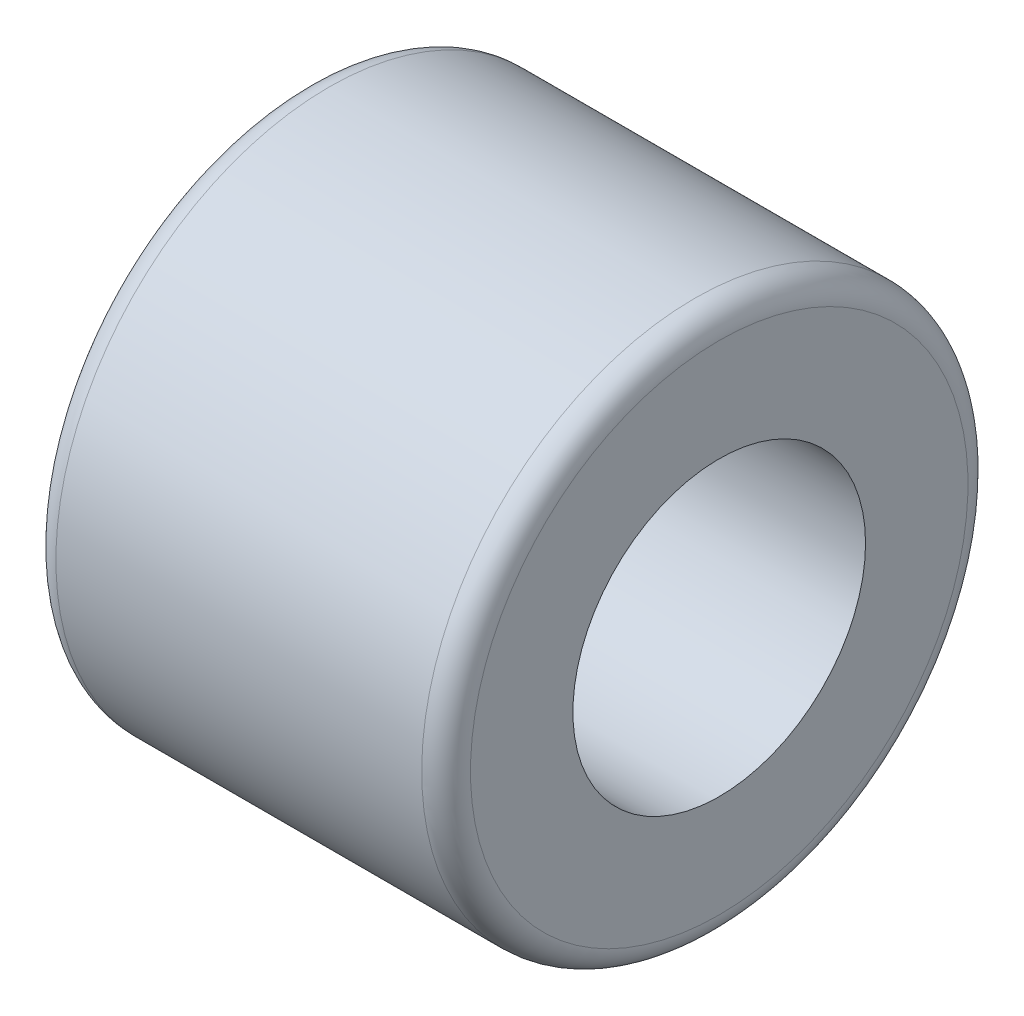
from build123d import *

# Parameters (mm, degrees)
ESQUISSE1_W             = 8.5
ESQUISSE1_H             = 5.6
ESQUISSE4_R             = 3
ENL_V_MAT_EXTRU_1_DEPTH = 16
CONG_1_R                = 0.5


with BuildPart() as part:
    # Esquisse1 → R_volution1 (revolve)
    with BuildSketch(Plane.XY):
        with Locations((-3.070359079, 2.8)):
            Rectangle(ESQUISSE1_W, ESQUISSE1_H)
    revolve(axis=Axis((1.179640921, 0, 0), (-1, 0, 0)))

    # Esquisse4 → Enl_v. mat.-Extru.1 (cut)
    with BuildSketch(Plane(origin=(1.179640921, 0, 0), x_dir=(0, 0, -1), z_dir=(1, 0, 0))):
        Circle(ESQUISSE4_R)
    extrude(amount=-ENL_V_MAT_EXTRU_1_DEPTH, mode=Mode.SUBTRACT)

    # Cong_1
    cong_1_edges = [part.edges().sort_by_distance(p)[0] for p in [
        (1.179640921, -5.6, 0),
        (-7.320359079, -5.6, 0),
    ]]
    fillet(cong_1_edges, radius=CONG_1_R)


solid = part.part
